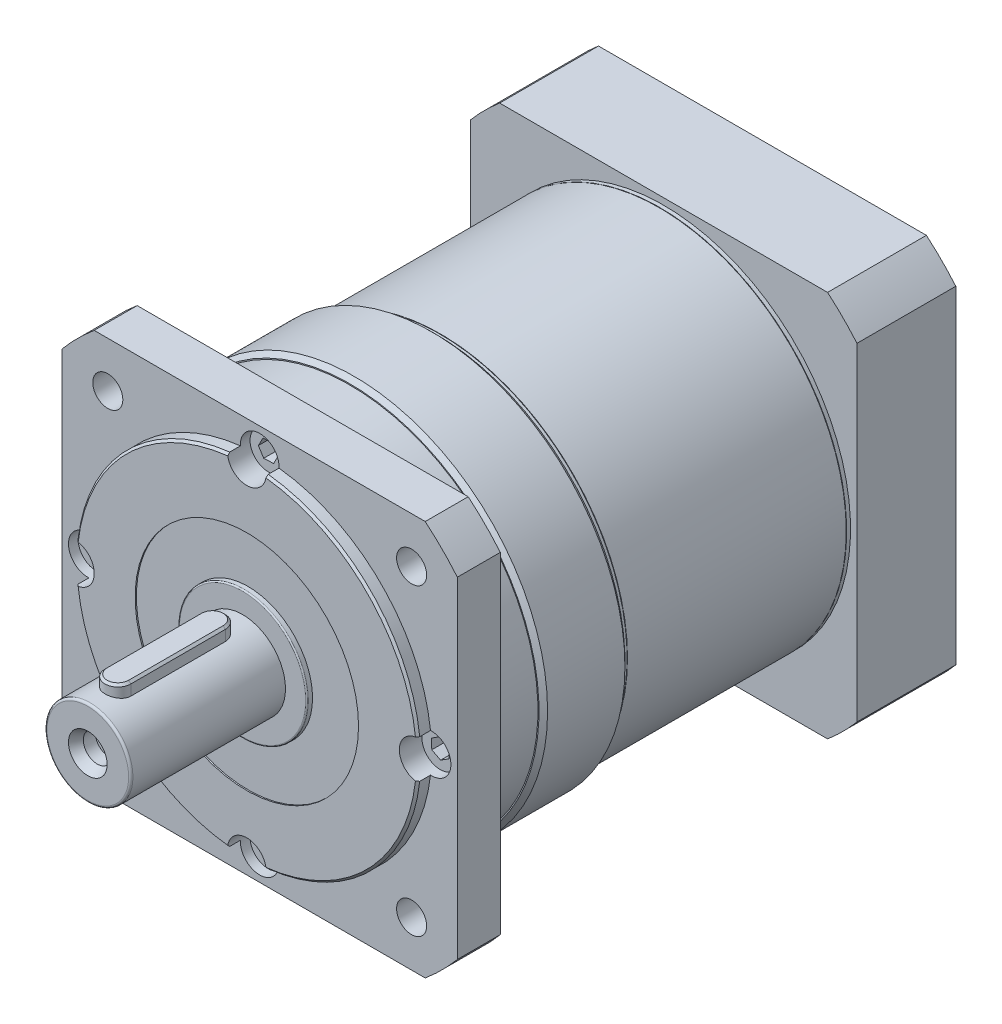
from build123d import *

# Parameters (mm, degrees)
SKETCH_1_R               = 45
EXTRUDE_1_DEPTH          = 42
SKETCH_2_R               = 40
EXTRUDE_2_DEPTH          = 3
SKETCH_3_OUTSIDE_W       = 119
SKETCH_3_OUTSIDE_H       = 119
SKETCH_3_OUTSIDE_R       = 43.5
CUT_EXTRUDE_1_DEPTH      = 1
SKETCH_25_W              = 92
SKETCH_25_H              = 92
EXTRUDE_13_DEPTH         = 10
SKETCH_26_OUTSIDE_W      = 121.534
SKETCH_26_OUTSIDE_H      = 121.534
SKETCH_26_OUTSIDE_R      = 60
CUT_EXTRUDE_8_DEPTH      = 10
SKETCH_27_R              = 3.5
CUT_EXTRUDE_9_DEPTH      = 10
PATTERN_CIRCULAR_6_COUNT = 4
SKETCH_28_OUTSIDE_W      = 121.534
SKETCH_28_OUTSIDE_H      = 121.534
SKETCH_28_OUTSIDE_R      = 43.75
CUT_EXTRUDE_10_DEPTH     = 11
CHAMFER_5_SIZE           = 1
CHAMFER_1_SIZE           = 1
SKETCH_4_R               = 43.5
EXTRUDE_3_DEPTH          = 50.9
SKETCH_5_R               = 43.5
EXTRUDE_4_DEPTH          = 0.9
EXTRUDE_5_DEPTH          = 23
SKETCH_7_R               = 35
CUT_EXTRUDE_2_DEPTH      = 6
SKETCH_8_R               = 32
CUT_EXTRUDE_3_DEPTH      = 20
SKETCH_9_R               = 4.5
CUT_EXTRUDE_4_DEPTH      = 14
PATTERN_CIRCULAR_1_COUNT = 4
PATTERN_CIRCULAR_2_COUNT = 4
SKETCH_12_R              = 4.25
EXTRUDE_6_DEPTH          = 5
PATTERN_CIRCULAR_3_COUNT = 4
SKETCH_13_R              = 4.5
CUT_EXTRUDE_5_DEPTH      = 7
PATTERN_CIRCULAR_4_COUNT = 4
SKETCH_14_R              = 4.25
EXTRUDE_7_DEPTH          = 5
PATTERN_CIRCULAR_5_COUNT = 4
SKETCH_17_R              = 26
EXTRUDE_8_DEPTH          = 19
CHAMFER_2_SIZE           = 1.5
SKETCH_18_W              = 61.385276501
SKETCH_18_H              = 1
CUT_EXTRUDE_6_DEPTH      = 19
SKETCH_19_R              = 9.5
CUT_EXTRUDE_7_DEPTH      = 42
CHAMFER_3_SIZE           = 0.5
SKETCH_20_R              = 15
EXTRUDE_9_DEPTH          = 1
FILLET_2_R               = 0.3
SKETCH_22_R              = 10
EXTRUDE_10_DEPTH         = 36
FILLET_3_R               = 0.5
EXTRUDE_11_DEPTH         = 12.5
CHAMFER_4_SIZE           = 0.5
SKETCH_30_R              = 4.5
CUT_EXTRUDE_11_DEPTH     = 3
PATTERN_CIRCULAR_8_COUNT = 4
SKETCH_32_R              = 3.25
CUT_EXTRUDE_12_DEPTH     = 5
SKETCH_33_R              = 3.25
SKETCH_31_R              = 4.5
CUT_EXTRUDE_START        = -0.3
SKETCH_35_R              = 26
SKETCH_35_R_2            = 15
CUT_EXTRUDE_13_DEPTH     = 0.3


with BuildPart() as part:
    # Sketch 1 → Extrude 1 (new body)
    with BuildSketch(Plane.XY):
        with Locations(Location((0, 0, 0), (0, 0, 180))):
            Circle(SKETCH_1_R)
    extrude(amount=EXTRUDE_1_DEPTH)

    # Sketch 2 → Extrude 2 (add)
    with BuildSketch(Plane.XY.offset(42)):
        Circle(SKETCH_2_R)
    extrude(amount=EXTRUDE_2_DEPTH)

    # Sketch 3 outside → Cut-Extrude 1 (cut)
    with BuildSketch(Plane(origin=(0, 0, 0), x_dir=(-1, 0, 0), z_dir=(0, 0, -1))):
        Rectangle(SKETCH_3_OUTSIDE_W, SKETCH_3_OUTSIDE_H)
        Circle(SKETCH_3_OUTSIDE_R, mode=Mode.SUBTRACT)
    extrude(amount=-CUT_EXTRUDE_1_DEPTH, mode=Mode.SUBTRACT)

    # Sketch 25 → Extrude 13 (add)
    with BuildSketch(Plane.XY.offset(42)):
        Rectangle(SKETCH_25_W, SKETCH_25_H)
    extrude(amount=-EXTRUDE_13_DEPTH)

    # Sketch 26 outside → Cut-Extrude 8 (cut)
    with BuildSketch(Plane.XY.offset(42)):
        Rectangle(SKETCH_26_OUTSIDE_W, SKETCH_26_OUTSIDE_H)
        Circle(SKETCH_26_OUTSIDE_R, mode=Mode.SUBTRACT)
    extrude(amount=-CUT_EXTRUDE_8_DEPTH, mode=Mode.SUBTRACT)

    # Sketch 27 → Cut-Extrude 9 (cut)
    with BuildSketch(Plane.XY.offset(42)):
        with Locations((-35.355339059, 35.355339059)):
            Circle(SKETCH_27_R)
    cut_extrude_9 = extrude(amount=-CUT_EXTRUDE_9_DEPTH, mode=Mode.SUBTRACT)

    # Pattern Circular 6: Cut-Extrude 9 ×4 about axis
    pattern_circular_6_axis = Axis((0, 0, 0), (0, 0, 1))
    for i in range(1, PATTERN_CIRCULAR_6_COUNT):
        add(cut_extrude_9.rotate(pattern_circular_6_axis, i * 360 / PATTERN_CIRCULAR_6_COUNT), mode=Mode.SUBTRACT)

    # Sketch 28 outside → Cut-Extrude 10 (cut)
    with BuildSketch(Plane(origin=(0, 0, 32), x_dir=(-1, 0, 0), z_dir=(0, 0, -1))):
        Rectangle(SKETCH_28_OUTSIDE_W, SKETCH_28_OUTSIDE_H)
        Circle(SKETCH_28_OUTSIDE_R, mode=Mode.SUBTRACT)
    extrude(amount=CUT_EXTRUDE_10_DEPTH, mode=Mode.SUBTRACT)

    # Chamfer 5
    chamfer_5_edges = [part.edges().sort_by_distance(p)[0] for p in [
        (45, 0, 21),
    ]]
    chamfer(chamfer_5_edges, length=CHAMFER_5_SIZE)

    # Chamfer 1
    chamfer_1_edges = [part.edges().sort_by_distance(p)[0] for p in [
        (45, 0, 1),
    ]]
    chamfer(chamfer_1_edges, length=CHAMFER_1_SIZE)

    # Sketch 13 → Cut-Extrude 5 (cut)
    with BuildSketch(Plane.XY.offset(42)):
        with Locations((0, -40)):
            Circle(SKETCH_13_R)
    cut_extrude_5 = extrude(amount=-CUT_EXTRUDE_5_DEPTH, mode=Mode.SUBTRACT)

    # Pattern Circular 4: Cut-Extrude 5 ×4 about axis
    pattern_circular_4_axis = Axis((0, 0, 0), (0, 0, 1))
    for i in range(1, PATTERN_CIRCULAR_4_COUNT):
        add(cut_extrude_5.rotate(pattern_circular_4_axis, i * 360 / PATTERN_CIRCULAR_4_COUNT), mode=Mode.SUBTRACT)

    # Sketch 14 → Extrude 7 (add)
    with BuildSketch(Plane.XY.offset(35)):
        with Locations((0, -40)):
            Circle(SKETCH_14_R)
        Polygon((1.070164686, -37.953519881), (-1.237221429, -38.049970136), (-2.307386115, -40.096450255), (-1.070164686, -42.046480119), (1.237221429, -41.950029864), (2.307386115, -39.903549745), align=None, mode=Mode.SUBTRACT)
    extrude_7 = extrude(amount=EXTRUDE_7_DEPTH)

    # Pattern Circular 5: Extrude 7 ×4 about axis
    pattern_circular_5_axis = Axis((0, 0, 0), (0, 0, 1))
    for i in range(1, PATTERN_CIRCULAR_5_COUNT):
        add(extrude_7.rotate(pattern_circular_5_axis, i * 360 / PATTERN_CIRCULAR_5_COUNT))

    # Chamfer 3
    chamfer_3_edges = [part.edges().sort_by_distance(p)[0] for p in [
        (-40, 0, 45),
    ]]
    chamfer(chamfer_3_edges, length=CHAMFER_3_SIZE)

    # Sketch 20 → Extrude 9 (add)
    with BuildSketch(Plane.XY.offset(45)):
        Circle(SKETCH_20_R)
    extrude(amount=EXTRUDE_9_DEPTH)

    # Fillet 2
    fillet_2_edges = [part.edges().sort_by_distance(p)[0] for p in [
        (-15, 0, 46),
    ]]
    fillet(fillet_2_edges, radius=FILLET_2_R)

    # Sketch 22 → Extrude 10 (add)
    with BuildSketch(Plane.XY.offset(46)):
        Circle(SKETCH_22_R)
    extrude(amount=EXTRUDE_10_DEPTH)

    # Fillet 3
    fillet_3_edges = [part.edges().sort_by_distance(p)[0] for p in [
        (-10, 0, 82),
    ]]
    fillet(fillet_3_edges, radius=FILLET_3_R)

    # Sketch 23 → Extrude 11 (add)
    with BuildSketch(Plane(origin=(0, 0, 0), x_dir=(1, 0, 0), z_dir=(0, 1, 0))):
        with BuildLine():
            Line((-3, -53), (-3, -75))
            ThreePointArc((-3, -75), (0, -78), (3, -75))
            Line((3, -75), (3, -53))
            ThreePointArc((3, -53), (0, -50), (-3, -53))
        make_face()
    extrude(amount=EXTRUDE_11_DEPTH)

    # Chamfer 4
    chamfer_4_edges = [part.edges().sort_by_distance(p)[0] for p in [
        (0, 12.5, 50),
        (-3, 12.5, 64),
        (0, 12.5, 78),
        (3, 12.5, 64),
    ]]
    chamfer(chamfer_4_edges, length=CHAMFER_4_SIZE)

    # Sketch 30 → Cut-Extrude 11 (cut)
    with BuildSketch(Plane.XY.offset(45)):
        with Locations(Location((0, 40, 0), (0, 0, 356.775410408))):
            Circle(SKETCH_30_R)
    cut_extrude_11 = extrude(amount=-CUT_EXTRUDE_11_DEPTH, mode=Mode.SUBTRACT)

    # Pattern Circular 8: Cut-Extrude 11 ×4 about axis
    pattern_circular_8_axis = Axis((0, 0, 45), (0, 0, -1))
    for i in range(1, PATTERN_CIRCULAR_8_COUNT):
        add(cut_extrude_11.rotate(pattern_circular_8_axis, i * 360 / PATTERN_CIRCULAR_8_COUNT), mode=Mode.SUBTRACT)

    # Sketch 32 → Cut-Extrude 12 (cut)
    with BuildSketch(Plane.XY.offset(82)):
        Circle(SKETCH_32_R)
    extrude(amount=-CUT_EXTRUDE_12_DEPTH, mode=Mode.SUBTRACT)

    # Sketch 33 → Loft 1 section 0
    with BuildSketch(Plane.XY.offset(79.8)):
        Circle(SKETCH_33_R)
    # Sketch 31 → Loft 1 section 1
    with BuildSketch(Plane.XY.offset(82)):
        Circle(SKETCH_31_R)
    loft(mode=Mode.SUBTRACT)

    # Sketch 34 → Hole Wizard M6 _1 (revolve, cut)
    with BuildSketch(Plane(origin=(0, 0, 77), x_dir=(0, -1, 0), z_dir=(1, 0, 0))):
        Polygon((0, 0), (0, 18.002151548), (2.5, 16.5), (2.5, 0), align=None)
    revolve(axis=Axis((0, 0, 83.35), (0, 0, -1)), mode=Mode.SUBTRACT)

    # Sketch 35 → Cut-Extrude 13 (cut)
    with BuildSketch(Plane.XY.offset(45).offset(CUT_EXTRUDE_START)):
        Circle(SKETCH_35_R)
        Circle(SKETCH_35_R_2, mode=Mode.SUBTRACT)
    extrude(amount=CUT_EXTRUDE_13_DEPTH, mode=Mode.SUBTRACT)


with BuildPart() as body_2:
    # Sketch 4 → Extrude 3 (new body)
    with BuildSketch(Plane(origin=(0, 0, -0.1), x_dir=(-1, 0, 0), z_dir=(0, 0, -1))):
        with Locations(Location((0, 0, 0), (0, 0, 180))):
            Circle(SKETCH_4_R)
    extrude(amount=EXTRUDE_3_DEPTH)


with BuildPart() as body_3:
    # Sketch 5 → Extrude 4 (new body)
    with BuildSketch(Plane(origin=(0, 0, -51.1), x_dir=(-1, 0, 0), z_dir=(0, 0, -1))):
        Circle(SKETCH_5_R)
    extrude(amount=EXTRUDE_4_DEPTH)

    # Sketch 6 → Extrude 5 (add)
    with BuildSketch(Plane(origin=(0, 0, -52), x_dir=(-1, 0, 0), z_dir=(0, 0, -1))):
        with BuildLine():
            Line((-38.157568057, 45), (38.157568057, 45))
            ThreePointArc((38.157568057, 45), (41.71930009, 41.71930009), (45, 38.157568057))
            Line((45, 38.157568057), (45, -38.157568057))
            ThreePointArc((45, -38.157568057), (41.71930009, -41.71930009), (38.157568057, -45))
            Line((38.157568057, -45), (-38.157568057, -45))
            ThreePointArc((-38.157568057, -45), (-41.71930009, -41.71930009), (-45, -38.157568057))
            Line((-45, -38.157568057), (-45, 38.157568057))
            ThreePointArc((-45, 38.157568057), (-41.71930009, 41.71930009), (-38.157568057, 45))
        make_face()
    extrude(amount=EXTRUDE_5_DEPTH)

    # Sketch 7 → Cut-Extrude 2 (cut)
    with BuildSketch(Plane(origin=(0, 0, -75), x_dir=(-1, 0, 0), z_dir=(0, 0, -1))):
        Circle(SKETCH_7_R)
    extrude(amount=-CUT_EXTRUDE_2_DEPTH, mode=Mode.SUBTRACT)


with BuildPart() as cut_extrude_3_tool:
    # Sketch 8 → Cut-Extrude 3 (new body)
    with BuildSketch(Plane(origin=(0, 0, -69), x_dir=(-1, 0, 0), z_dir=(0, 0, -1))):
        Circle(SKETCH_8_R)
    extrude(amount=-CUT_EXTRUDE_3_DEPTH)


with BuildPart() as body_2_1:
    add(body_2.part)

    # Cut-Extrude 3: cut by cut_extrude_3_tool
    add(cut_extrude_3_tool.part, mode=Mode.SUBTRACT)

    # Sketch 17 → Extrude 8 (add)
    with BuildSketch(Plane(origin=(0, 0, -68), x_dir=(-1, 0, 0), z_dir=(0, 0, -1))):
        Circle(SKETCH_17_R)
    extrude(amount=-EXTRUDE_8_DEPTH)

    # Chamfer 2
    chamfer_2_edges = [body_2_1.edges().sort_by_distance(p)[0] for p in [
        (26, 0, -68),
    ]]
    chamfer(chamfer_2_edges, length=CHAMFER_2_SIZE)

    # Sketch 18 → Cut-Extrude 6 (cut)
    with BuildSketch(Plane(origin=(0, 0, -68), x_dir=(-1, 0, 0), z_dir=(0, 0, -1))):
        with Locations((0.110137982, 0)):
            Rectangle(SKETCH_18_W, SKETCH_18_H)
    extrude(amount=-CUT_EXTRUDE_6_DEPTH, mode=Mode.SUBTRACT)

    # Sketch 19 → Cut-Extrude 7 (cut)
    with BuildSketch(Plane(origin=(0, 0, -75), x_dir=(-1, 0, 0), z_dir=(0, 0, -1))):
        Circle(SKETCH_19_R)
    extrude(amount=-CUT_EXTRUDE_7_DEPTH, mode=Mode.SUBTRACT)


with BuildPart() as body_3_1:
    add(body_3.part)

    # Cut-Extrude 3: cut by cut_extrude_3_tool
    add(cut_extrude_3_tool.part, mode=Mode.SUBTRACT)

    # Sketch 9 → Cut-Extrude 4 (cut)
    with BuildSketch(Plane(origin=(0, 0, -75), x_dir=(-1, 0, 0), z_dir=(0, 0, -1))):
        with Locations((-13.680805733, 37.587704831)):
            Circle(SKETCH_9_R)
    cut_extrude_4 = extrude(amount=-CUT_EXTRUDE_4_DEPTH, mode=Mode.SUBTRACT)

    # Pattern Circular 1: Cut-Extrude 4 ×4 about axis
    pattern_circular_1_axis = Axis((0, 0, 0), (0, 0, 1))
    for i in range(1, PATTERN_CIRCULAR_1_COUNT):
        add(cut_extrude_4.rotate(pattern_circular_1_axis, i * 360 / PATTERN_CIRCULAR_1_COUNT), mode=Mode.SUBTRACT)

    # Sketch 11 → Hole Wizard M5 _1 (revolve, cut)
    with BuildSketch(Plane(origin=(31.819805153, 31.819805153, -75), x_dir=(0, 1, 0), z_dir=(1, 0, 0))):
        Polygon((0, 0), (0, 17.2618073), (2.1, 16), (2.1, 0), align=None)
    hole_wizard_m5_1 = revolve(axis=Axis((31.819805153, 31.819805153, -81.35), (0, 0, 1)), mode=Mode.SUBTRACT)

    # Pattern Circular 2: Hole Wizard M5 _1 ×4 about axis
    pattern_circular_2_axis = Axis((0, 0, 0), (0, 0, 1))
    for i in range(1, PATTERN_CIRCULAR_2_COUNT):
        add(hole_wizard_m5_1.rotate(pattern_circular_2_axis, i * 360 / PATTERN_CIRCULAR_2_COUNT), mode=Mode.SUBTRACT)

    # Sketch 12 → Extrude 6 (add)
    with BuildSketch(Plane(origin=(0, 0, -61), x_dir=(-1, 0, 0), z_dir=(0, 0, -1))):
        with Locations((-13.680805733, 37.587704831)):
            Circle(SKETCH_12_R)
        Polygon((-12.613258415, 39.635551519), (-14.920519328, 39.536151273), (-15.988066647, 37.488304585), (-14.748353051, 35.539858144), (-12.441092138, 35.63925839), (-11.373544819, 37.687105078), align=None, mode=Mode.SUBTRACT)
    extrude_6 = extrude(amount=EXTRUDE_6_DEPTH)

    # Pattern Circular 3: Extrude 6 ×4 about axis
    pattern_circular_3_axis = Axis((0, 0, 0), (0, 0, 1))
    for i in range(1, PATTERN_CIRCULAR_3_COUNT):
        add(extrude_6.rotate(pattern_circular_3_axis, i * 360 / PATTERN_CIRCULAR_3_COUNT))


solid = Compound([part.part, body_2_1.part, body_3_1.part])
